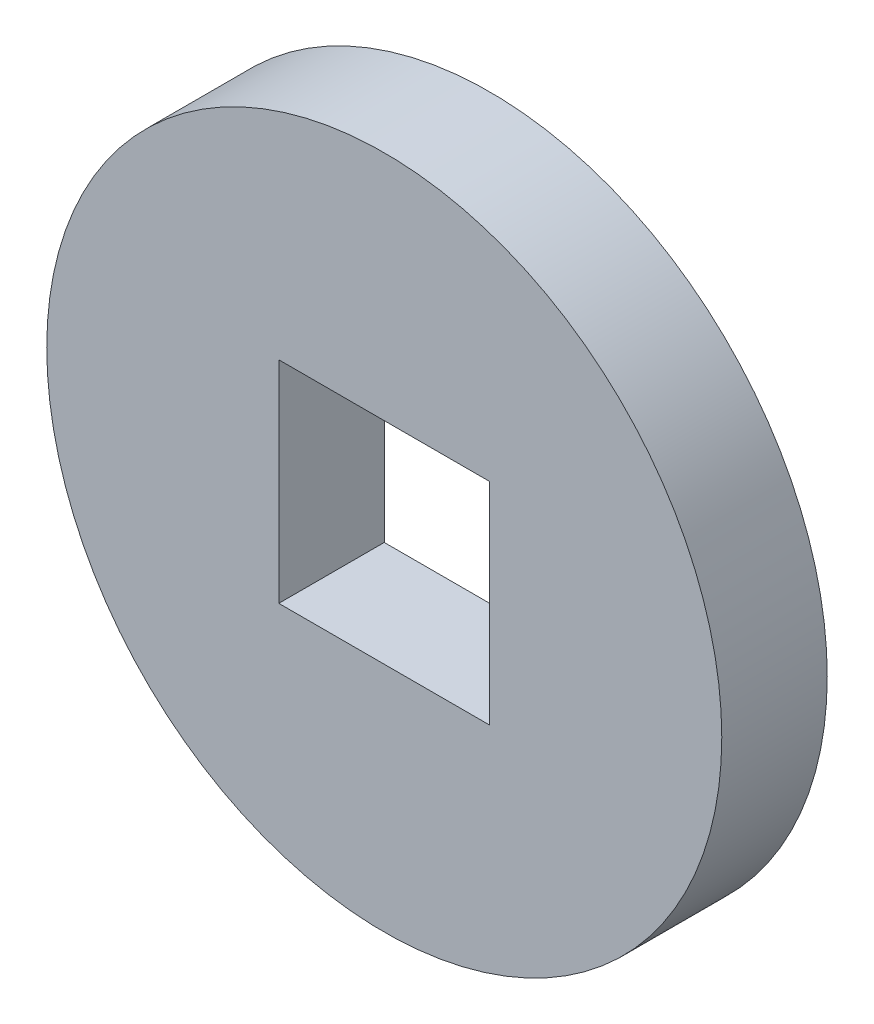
from build123d import *

# Parameters (mm, degrees)
SKETCH1_R           = 10.16
SKETCH1_W           = 6.35
SKETCH1_H           = 6.35
BOSS_EXTRUDE3_DEPTH = 3.175


with BuildPart() as part:
    # Sketch1 → Boss-Extrude3 (new body)
    with BuildSketch(Plane.XY):
        Circle(SKETCH1_R)
        Rectangle(SKETCH1_W, SKETCH1_H, mode=Mode.SUBTRACT)
    extrude(amount=BOSS_EXTRUDE3_DEPTH)


solid = part.part
